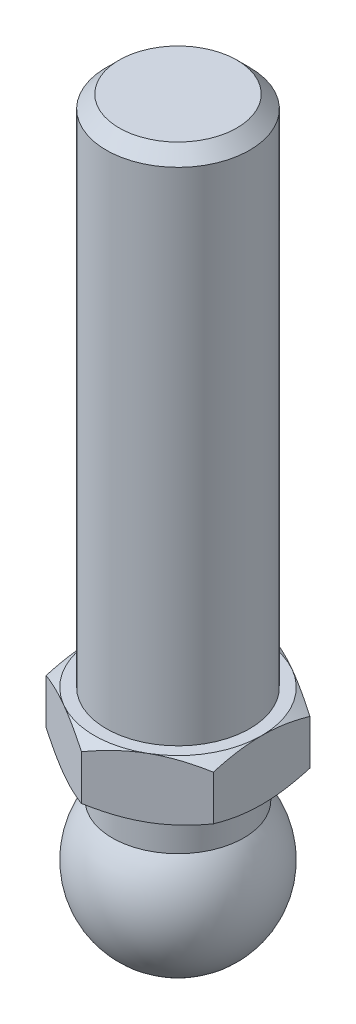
ISO-10303-21;
HEADER;
FILE_DESCRIPTION(('STEP AP214'),'2;1');
FILE_NAME('part.step','',(''),(''),'','','');
FILE_SCHEMA(('AUTOMOTIVE_DESIGN { 1 0 10303 214 1 1 1 1 }'));
ENDSEC;
DATA;
#1=APPLICATION_CONTEXT('core data for automotive mechanical design processes');
#2=APPLICATION_PROTOCOL_DEFINITION('international standard','automotive_design',2000,#1);
#3=PRODUCT_CONTEXT('',#1,'mechanical');
#4=PRODUCT('Part','Part','',(#3));
#5=PRODUCT_RELATED_PRODUCT_CATEGORY('part','',(#4));
#6=PRODUCT_DEFINITION_FORMATION('','',#4);
#7=PRODUCT_DEFINITION_CONTEXT('part definition',#1,'design');
#8=PRODUCT_DEFINITION('design','',#6,#7);
#9=PRODUCT_DEFINITION_SHAPE('','',#8);
#10=(LENGTH_UNIT() NAMED_UNIT(*) SI_UNIT(.MILLI.,.METRE.));
#11=(NAMED_UNIT(*) PLANE_ANGLE_UNIT() SI_UNIT($,.RADIAN.));
#12=(NAMED_UNIT(*) SI_UNIT($,.STERADIAN.) SOLID_ANGLE_UNIT());
#13=UNCERTAINTY_MEASURE_WITH_UNIT(LENGTH_MEASURE(1.E-05),#10,'distance_accuracy_value','');
#14=(GEOMETRIC_REPRESENTATION_CONTEXT(3) GLOBAL_UNCERTAINTY_ASSIGNED_CONTEXT((#13)) GLOBAL_UNIT_ASSIGNED_CONTEXT((#10,
#11,#12)) REPRESENTATION_CONTEXT('',''));
#15=CARTESIAN_POINT('',(0.,0.,0.));
#16=DIRECTION('',(0.,0.,1.));
#17=DIRECTION('',(1.,0.,0.));
#18=AXIS2_PLACEMENT_3D('',#15,#16,#17);
#19=CARTESIAN_POINT('',(0.,19.5,0.));
#20=DIRECTION('',(0.,-1.,0.));
#21=DIRECTION('',(0.,0.,-1.));
#22=AXIS2_PLACEMENT_3D('',#19,#20,#21);
#23=CONICAL_SURFACE('',#22,7.,1.0471975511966);
#24=CARTESIAN_POINT('',(-7.,15.2688336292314,12.5023453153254));
#25=CARTESIAN_POINT('',(-7.,15.4184696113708,12.2052647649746));
#26=CARTESIAN_POINT('',(-7.,15.5671267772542,11.9076861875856));
#27=CARTESIAN_POINT('',(-7.,15.8620076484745,11.3113035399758));
#28=CARTESIAN_POINT('',(-7.,16.0082312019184,11.0124993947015));
#29=CARTESIAN_POINT('',(-7.,16.2980281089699,10.4128982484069));
#30=CARTESIAN_POINT('',(-7.,16.441595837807,10.1120985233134));
#31=CARTESIAN_POINT('',(-7.,16.7251296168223,9.50881013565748));
#32=CARTESIAN_POINT('',(-7.,16.8650957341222,9.20632150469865));
#33=CARTESIAN_POINT('',(-7.,17.1470427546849,8.58510325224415));
#34=CARTESIAN_POINT('',(-7.,17.2888108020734,8.26627671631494));
#35=CARTESIAN_POINT('',(-7.,17.5662200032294,7.62594250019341));
#36=CARTESIAN_POINT('',(-7.,17.7018608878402,7.30443470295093));
#37=CARTESIAN_POINT('',(-7.,17.9652496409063,6.65840905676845));
#38=CARTESIAN_POINT('',(-7.,18.0930022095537,6.33389313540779));
#39=CARTESIAN_POINT('',(-7.,18.3384540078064,5.68109770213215));
#40=CARTESIAN_POINT('',(-7.,18.4561543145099,5.35281859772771));
#41=CARTESIAN_POINT('',(-7.,18.7028165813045,4.61998548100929));
#42=CARTESIAN_POINT('',(-7.,18.8286623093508,4.21436746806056));
#43=CARTESIAN_POINT('',(-7.,19.0543524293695,3.39574912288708));
#44=CARTESIAN_POINT('',(-7.,19.1541980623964,2.98274914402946));
#45=CARTESIAN_POINT('',(-7.,19.2776062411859,2.36178861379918));
#46=CARTESIAN_POINT('',(-7.,19.3141378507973,2.15638627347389));
#47=CARTESIAN_POINT('',(-7.,19.3780104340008,1.74416917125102));
#48=CARTESIAN_POINT('',(-7.,19.4053527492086,1.53735462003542));
#49=CARTESIAN_POINT('',(-7.,19.4500375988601,1.1227076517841));
#50=CARTESIAN_POINT('',(-7.,19.467383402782,0.914875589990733));
#51=CARTESIAN_POINT('',(-7.,19.4915250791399,0.498594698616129));
#52=CARTESIAN_POINT('',(-7.,19.4983210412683,0.290145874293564));
#53=CARTESIAN_POINT('',(-7.,19.5011397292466,-0.128421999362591));
#54=CARTESIAN_POINT('',(-7.,19.4970795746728,-0.338541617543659));
#55=CARTESIAN_POINT('',(-7.,19.4781521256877,-0.758289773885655));
#56=CARTESIAN_POINT('',(-7.,19.463284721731,-0.967918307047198));
#57=CARTESIAN_POINT('',(-7.,19.4232345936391,-1.38625975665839));
#58=CARTESIAN_POINT('',(-7.,19.3980479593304,-1.59497229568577));
#59=CARTESIAN_POINT('',(-7.,19.3381380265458,-2.01100790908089));
#60=CARTESIAN_POINT('',(-7.,19.3034145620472,-2.21833095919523));
#61=CARTESIAN_POINT('',(-7.,19.1849408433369,-2.84522045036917));
#62=CARTESIAN_POINT('',(-7.,19.0876569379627,-3.26225118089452));
#63=CARTESIAN_POINT('',(-7.,18.8658468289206,-4.08879182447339));
#64=CARTESIAN_POINT('',(-7.,18.7413180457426,-4.4983010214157));
#65=CARTESIAN_POINT('',(-7.,18.4953846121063,-5.2406101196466));
#66=CARTESIAN_POINT('',(-7.,18.3771372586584,-5.5744719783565));
#67=CARTESIAN_POINT('',(-7.,18.1300009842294,-6.23825206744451));
#68=CARTESIAN_POINT('',(-7.,18.0011107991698,-6.56816982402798));
#69=CARTESIAN_POINT('',(-7.,17.7350197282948,-7.22486424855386));
#70=CARTESIAN_POINT('',(-7.,17.5978135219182,-7.55163874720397));
#71=CARTESIAN_POINT('',(-7.,17.3169731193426,-8.20238370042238));
#72=CARTESIAN_POINT('',(-7.,17.1733392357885,-8.5263542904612));
#73=CARTESIAN_POINT('',(-7.,16.8876445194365,-9.15729037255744));
#74=CARTESIAN_POINT('',(-7.,16.7458097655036,-9.46435857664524));
#75=CARTESIAN_POINT('',(-7.,16.4583976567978,-10.0767426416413));
#76=CARTESIAN_POINT('',(-7.,16.3128202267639,-10.3820584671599));
#77=CARTESIAN_POINT('',(-7.,16.018926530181,-10.990585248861));
#78=CARTESIAN_POINT('',(-7.,15.8706165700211,-11.2937992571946));
#79=CARTESIAN_POINT('',(-7.,15.5714843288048,-11.8989613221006));
#80=CARTESIAN_POINT('',(-7.,15.4206622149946,-12.2009094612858));
#81=CARTESIAN_POINT('',(-7.,15.2688336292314,-12.5023453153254));
#82=B_SPLINE_CURVE_WITH_KNOTS('',3,(#24,#25,#26,#27,#28,#29,#30,#31,#32,#33,#34,#35,#36,#37,#38,
#39,#40,#41,#42,#43,#44,#45,#46,#47,#48,#49,#50,#51,#52,#53,#54,#55,#56,#57,#58,#59,#60,#61,#62,
#63,#64,#65,#66,#67,#68,#69,#70,#71,#72,#73,#74,#75,#76,#77,#78,#79,#80,#81),.UNSPECIFIED.,.F.,
.F.,(4,2,2,2,2,2,2,2,2,2,2,2,2,2,2,2,2,2,2,2,2,2,2,2,2,2,2,2,4),(0.,0.997917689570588,
1.99589743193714,2.99579247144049,3.99566886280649,5.04239250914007,6.08916209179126,
7.13530182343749,8.18132932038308,9.45480706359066,10.7282240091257,11.3539282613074,
11.9795411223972,12.6049492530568,13.2303520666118,13.8605430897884,14.490740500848,
15.1211769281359,15.7516243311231,17.0349275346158,18.3183522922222,19.380686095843,
20.4431462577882,21.506293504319,22.5693890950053,23.5840866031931,24.5988045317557,
25.6114179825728,26.6239642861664),.UNSPECIFIED.);
#83=CARTESIAN_POINT('',(-7.,18.8747852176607,4.04145188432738));
#84=VERTEX_POINT('',#83);
#85=CARTESIAN_POINT('',(-7.,19.5,0.));
#86=VERTEX_POINT('',#85);
#87=EDGE_CURVE('E258',#84,#86,#82,.T.);
#88=ORIENTED_EDGE('',*,*,#87,.F.);
#89=CARTESIAN_POINT('',(0.0002,18.8747185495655,8.0830192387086));
#90=CARTESIAN_POINT('',(-0.153667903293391,18.9260001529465,7.99418356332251));
#91=CARTESIAN_POINT('',(-0.30810950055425,18.9749544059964,7.90501666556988));
#92=CARTESIAN_POINT('',(-0.618246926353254,19.0675672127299,7.72595873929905));
#93=CARTESIAN_POINT('',(-0.773943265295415,19.1112234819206,7.63606741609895));
#94=CARTESIAN_POINT('',(-1.24352516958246,19.2333884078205,7.36495417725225));
#95=CARTESIAN_POINT('',(-1.5592643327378,19.302874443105,7.18266208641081));
#96=CARTESIAN_POINT('',(-2.03176224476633,19.3843550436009,6.9098652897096));
#97=CARTESIAN_POINT('',(-2.18710922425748,19.4075665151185,6.82017566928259));
#98=CARTESIAN_POINT('',(-2.49850511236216,19.4464887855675,6.64039116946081));
#99=CARTESIAN_POINT('',(-2.65455395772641,19.4622002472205,6.55029632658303));
#100=CARTESIAN_POINT('',(-2.96692267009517,19.4857220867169,6.36995016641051));
#101=CARTESIAN_POINT('',(-3.12324202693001,19.4935414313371,6.27969914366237));
#102=CARTESIAN_POINT('',(-3.43601650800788,19.5011197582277,6.09911871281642));
#103=CARTESIAN_POINT('',(-3.59247162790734,19.500878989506,6.00878930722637));
#104=CARTESIAN_POINT('',(-4.02110687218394,19.4891402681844,5.76131663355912));
#105=CARTESIAN_POINT('',(-4.2931466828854,19.4694342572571,5.60425437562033));
#106=CARTESIAN_POINT('',(-4.83541944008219,19.4069465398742,5.29117305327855));
#107=CARTESIAN_POINT('',(-5.10565047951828,19.364143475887,5.13515508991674));
#108=CARTESIAN_POINT('',(-5.64901454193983,19.2571483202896,4.82144370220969));
#109=CARTESIAN_POINT('',(-5.92207900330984,19.1925029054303,4.66378986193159));
#110=CARTESIAN_POINT('',(-6.46413578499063,19.045783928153,4.35083323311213));
#111=CARTESIAN_POINT('',(-6.73313504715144,18.9637448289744,4.19552643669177));
#112=CARTESIAN_POINT('',(-7.0002,18.8747185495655,4.04133641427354));
#113=B_SPLINE_CURVE_WITH_KNOTS('',3,(#89,#90,#91,#92,#93,#94,#95,#96,#97,#98,#99,#100,#101,#102,
#103,#104,#105,#106,#107,#108,#109,#110,#111,#112),.UNSPECIFIED.,.F.,.F.,(4,2,2,2,2,2,2,2,2,2,2,
4),(0.,0.554727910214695,1.10969417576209,2.2219327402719,2.76443041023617,3.30688013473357,
3.8487128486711,4.39052882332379,5.33376515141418,6.27787517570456,7.2429241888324,
8.20607866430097),.UNSPECIFIED.);
#114=CARTESIAN_POINT('',(-3.5,19.5,6.06217782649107));
#115=VERTEX_POINT('',#114);
#116=EDGE_CURVE('E144',#115,#84,#113,.T.);
#117=ORIENTED_EDGE('',*,*,#116,.F.);
#118=CARTESIAN_POINT('',(0.,19.5,0.));
#119=DIRECTION('',(0.,-1.,0.));
#120=DIRECTION('',(0.,0.,-1.));
#121=AXIS2_PLACEMENT_3D('',#118,#119,#120);
#122=CIRCLE('',#121,7.);
#123=EDGE_CURVE('E226',#115,#86,#122,.T.);
#124=ORIENTED_EDGE('',*,*,#123,.T.);
#125=EDGE_LOOP('',(#88,#117,#124));
#126=FACE_BOUND('',#125,.T.);
#127=ADVANCED_FACE('F17',(#126),#23,.T.);
#128=CARTESIAN_POINT('',(-7.,18.8747852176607,-4.04145188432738));
#129=VERTEX_POINT('',#128);
#130=EDGE_CURVE('E260',#86,#129,#82,.T.);
#131=ORIENTED_EDGE('',*,*,#130,.F.);
#132=CARTESIAN_POINT('',(-3.5,19.5,-6.06217782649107));
#133=VERTEX_POINT('',#132);
#134=EDGE_CURVE('E243',#86,#133,#122,.T.);
#135=ORIENTED_EDGE('',*,*,#134,.T.);
#136=CARTESIAN_POINT('',(-7.0002,18.8747185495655,-4.04133641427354));
#137=CARTESIAN_POINT('',(-6.84633209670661,18.9260001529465,-4.13017208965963));
#138=CARTESIAN_POINT('',(-6.69189049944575,18.9749544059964,-4.21933898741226));
#139=CARTESIAN_POINT('',(-6.38175307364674,19.0675672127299,-4.39839691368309));
#140=CARTESIAN_POINT('',(-6.22605673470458,19.1112234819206,-4.48828823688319));
#141=CARTESIAN_POINT('',(-5.75647483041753,19.2333884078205,-4.75940147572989));
#142=CARTESIAN_POINT('',(-5.4407356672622,19.302874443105,-4.94169356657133));
#143=CARTESIAN_POINT('',(-4.96823775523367,19.3843550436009,-5.21449036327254));
#144=CARTESIAN_POINT('',(-4.81289077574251,19.4075665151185,-5.30417998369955));
#145=CARTESIAN_POINT('',(-4.50149488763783,19.4464887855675,-5.48396448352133));
#146=CARTESIAN_POINT('',(-4.34544604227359,19.4622002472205,-5.57405932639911));
#147=CARTESIAN_POINT('',(-4.03307732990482,19.4857220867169,-5.75440548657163));
#148=CARTESIAN_POINT('',(-3.87675797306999,19.4935414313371,-5.84465650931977));
#149=CARTESIAN_POINT('',(-3.56398349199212,19.5011197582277,-6.02523694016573));
#150=CARTESIAN_POINT('',(-3.40752837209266,19.500878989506,-6.11556634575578));
#151=CARTESIAN_POINT('',(-2.97889312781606,19.4891402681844,-6.36303901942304));
#152=CARTESIAN_POINT('',(-2.7068533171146,19.4694342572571,-6.52010127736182));
#153=CARTESIAN_POINT('',(-2.1645805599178,19.4069465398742,-6.83318259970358));
#154=CARTESIAN_POINT('',(-1.89434952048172,19.364143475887,-6.9892005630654));
#155=CARTESIAN_POINT('',(-1.35098545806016,19.2571483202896,-7.30291195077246));
#156=CARTESIAN_POINT('',(-1.07792099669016,19.1925029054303,-7.46056579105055));
#157=CARTESIAN_POINT('',(-0.53586421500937,19.045783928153,-7.77352241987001));
#158=CARTESIAN_POINT('',(-0.26686495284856,18.9637448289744,-7.92882921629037));
#159=CARTESIAN_POINT('',(0.000200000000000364,18.8747185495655,-8.0830192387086));
#160=B_SPLINE_CURVE_WITH_KNOTS('',3,(#136,#137,#138,#139,#140,#141,#142,#143,#144,#145,#146,
#147,#148,#149,#150,#151,#152,#153,#154,#155,#156,#157,#158,#159),.UNSPECIFIED.,.F.,.F.,(4,2,2,
2,2,2,2,2,2,2,2,4),(0.,0.554727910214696,1.10969417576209,2.2219327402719,2.76443041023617,
3.30688013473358,3.8487128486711,4.39052882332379,5.33376515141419,6.27787517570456,
7.2429241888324,8.20607866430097),.UNSPECIFIED.);
#161=EDGE_CURVE('E301',#129,#133,#160,.T.);
#162=ORIENTED_EDGE('',*,*,#161,.F.);
#163=EDGE_LOOP('',(#131,#135,#162));
#164=FACE_BOUND('',#163,.T.);
#165=ADVANCED_FACE('F182',(#164),#23,.T.);
#166=CARTESIAN_POINT('',(0.,18.8747852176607,-8.08290376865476));
#167=VERTEX_POINT('',#166);
#168=EDGE_CURVE('E296',#133,#167,#160,.T.);
#169=ORIENTED_EDGE('',*,*,#168,.F.);
#170=CARTESIAN_POINT('',(3.5,19.5,-6.06217782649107));
#171=VERTEX_POINT('',#170);
#172=EDGE_CURVE('E237',#133,#171,#122,.T.);
#173=ORIENTED_EDGE('',*,*,#172,.T.);
#174=CARTESIAN_POINT('',(-0.0002,18.8747185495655,-8.0830192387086));
#175=CARTESIAN_POINT('',(0.153667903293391,18.9260001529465,-7.99418356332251));
#176=CARTESIAN_POINT('',(0.30810950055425,18.9749544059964,-7.90501666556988));
#177=CARTESIAN_POINT('',(0.618246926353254,19.0675672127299,-7.72595873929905));
#178=CARTESIAN_POINT('',(0.773943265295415,19.1112234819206,-7.63606741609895));
#179=CARTESIAN_POINT('',(1.24352516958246,19.2333884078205,-7.36495417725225));
#180=CARTESIAN_POINT('',(1.5592643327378,19.302874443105,-7.18266208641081));
#181=CARTESIAN_POINT('',(2.03176224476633,19.3843550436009,-6.9098652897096));
#182=CARTESIAN_POINT('',(2.18710922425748,19.4075665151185,-6.82017566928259));
#183=CARTESIAN_POINT('',(2.49850511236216,19.4464887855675,-6.64039116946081));
#184=CARTESIAN_POINT('',(2.65455395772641,19.4622002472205,-6.55029632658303));
#185=CARTESIAN_POINT('',(2.96692267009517,19.4857220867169,-6.36995016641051));
#186=CARTESIAN_POINT('',(3.12324202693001,19.4935414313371,-6.27969914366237));
#187=CARTESIAN_POINT('',(3.43601650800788,19.5011197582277,-6.09911871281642));
#188=CARTESIAN_POINT('',(3.59247162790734,19.500878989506,-6.00878930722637));
#189=CARTESIAN_POINT('',(4.02110687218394,19.4891402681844,-5.76131663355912));
#190=CARTESIAN_POINT('',(4.2931466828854,19.4694342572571,-5.60425437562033));
#191=CARTESIAN_POINT('',(4.83541944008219,19.4069465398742,-5.29117305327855));
#192=CARTESIAN_POINT('',(5.10565047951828,19.364143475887,-5.13515508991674));
#193=CARTESIAN_POINT('',(5.64901454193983,19.2571483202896,-4.82144370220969));
#194=CARTESIAN_POINT('',(5.92207900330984,19.1925029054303,-4.66378986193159));
#195=CARTESIAN_POINT('',(6.46413578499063,19.045783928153,-4.35083323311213));
#196=CARTESIAN_POINT('',(6.73313504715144,18.9637448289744,-4.19552643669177));
#197=CARTESIAN_POINT('',(7.0002,18.8747185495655,-4.04133641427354));
#198=B_SPLINE_CURVE_WITH_KNOTS('',3,(#174,#175,#176,#177,#178,#179,#180,#181,#182,#183,#184,
#185,#186,#187,#188,#189,#190,#191,#192,#193,#194,#195,#196,#197),.UNSPECIFIED.,.F.,.F.,(4,2,2,
2,2,2,2,2,2,2,2,4),(0.,0.554727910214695,1.10969417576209,2.2219327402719,2.76443041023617,
3.30688013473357,3.8487128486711,4.39052882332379,5.33376515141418,6.27787517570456,
7.2429241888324,8.20607866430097),.UNSPECIFIED.);
#199=EDGE_CURVE('E307',#167,#171,#198,.T.);
#200=ORIENTED_EDGE('',*,*,#199,.F.);
#201=EDGE_LOOP('',(#169,#173,#200));
#202=FACE_BOUND('',#201,.T.);
#203=ADVANCED_FACE('F189',(#202),#23,.T.);
#204=CARTESIAN_POINT('',(7.,18.8747852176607,-4.04145188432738));
#205=VERTEX_POINT('',#204);
#206=EDGE_CURVE('E309',#171,#205,#198,.T.);
#207=ORIENTED_EDGE('',*,*,#206,.F.);
#208=CARTESIAN_POINT('',(7.,19.5,0.));
#209=VERTEX_POINT('',#208);
#210=EDGE_CURVE('E233',#171,#209,#122,.T.);
#211=ORIENTED_EDGE('',*,*,#210,.T.);
#212=CARTESIAN_POINT('',(7.,15.2688336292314,-12.5023453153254));
#213=CARTESIAN_POINT('',(7.,15.4184696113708,-12.2052647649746));
#214=CARTESIAN_POINT('',(7.,15.5671267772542,-11.9076861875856));
#215=CARTESIAN_POINT('',(7.,15.8620076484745,-11.3113035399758));
#216=CARTESIAN_POINT('',(7.,16.0082312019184,-11.0124993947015));
#217=CARTESIAN_POINT('',(7.,16.2980281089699,-10.4128982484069));
#218=CARTESIAN_POINT('',(7.,16.441595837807,-10.1120985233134));
#219=CARTESIAN_POINT('',(7.,16.7251296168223,-9.50881013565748));
#220=CARTESIAN_POINT('',(7.,16.8650957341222,-9.20632150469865));
#221=CARTESIAN_POINT('',(7.,17.1470427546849,-8.58510325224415));
#222=CARTESIAN_POINT('',(7.,17.2888108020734,-8.26627671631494));
#223=CARTESIAN_POINT('',(7.,17.5662200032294,-7.62594250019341));
#224=CARTESIAN_POINT('',(7.,17.7018608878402,-7.30443470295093));
#225=CARTESIAN_POINT('',(7.,17.9652496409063,-6.65840905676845));
#226=CARTESIAN_POINT('',(7.,18.0930022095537,-6.33389313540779));
#227=CARTESIAN_POINT('',(7.,18.3384540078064,-5.68109770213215));
#228=CARTESIAN_POINT('',(7.,18.4561543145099,-5.35281859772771));
#229=CARTESIAN_POINT('',(7.,18.7028165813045,-4.61998548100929));
#230=CARTESIAN_POINT('',(7.,18.8286623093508,-4.21436746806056));
#231=CARTESIAN_POINT('',(7.,19.0543524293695,-3.39574912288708));
#232=CARTESIAN_POINT('',(7.,19.1541980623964,-2.98274914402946));
#233=CARTESIAN_POINT('',(7.,19.2776062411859,-2.36178861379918));
#234=CARTESIAN_POINT('',(7.,19.3141378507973,-2.15638627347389));
#235=CARTESIAN_POINT('',(7.,19.3780104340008,-1.74416917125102));
#236=CARTESIAN_POINT('',(7.,19.4053527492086,-1.53735462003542));
#237=CARTESIAN_POINT('',(7.,19.4500375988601,-1.1227076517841));
#238=CARTESIAN_POINT('',(7.,19.467383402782,-0.914875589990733));
#239=CARTESIAN_POINT('',(7.,19.4915250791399,-0.498594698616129));
#240=CARTESIAN_POINT('',(7.,19.4983210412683,-0.290145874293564));
#241=CARTESIAN_POINT('',(7.,19.5011397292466,0.128421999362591));
#242=CARTESIAN_POINT('',(7.,19.4970795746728,0.338541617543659));
#243=CARTESIAN_POINT('',(7.,19.4781521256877,0.758289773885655));
#244=CARTESIAN_POINT('',(7.,19.463284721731,0.967918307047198));
#245=CARTESIAN_POINT('',(7.,19.4232345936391,1.38625975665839));
#246=CARTESIAN_POINT('',(7.,19.3980479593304,1.59497229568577));
#247=CARTESIAN_POINT('',(7.,19.3381380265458,2.01100790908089));
#248=CARTESIAN_POINT('',(7.,19.3034145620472,2.21833095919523));
#249=CARTESIAN_POINT('',(7.,19.1849408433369,2.84522045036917));
#250=CARTESIAN_POINT('',(7.,19.0876569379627,3.26225118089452));
#251=CARTESIAN_POINT('',(7.,18.8658468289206,4.08879182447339));
#252=CARTESIAN_POINT('',(7.,18.7413180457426,4.4983010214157));
#253=CARTESIAN_POINT('',(7.,18.4953846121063,5.2406101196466));
#254=CARTESIAN_POINT('',(7.,18.3771372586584,5.5744719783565));
#255=CARTESIAN_POINT('',(7.,18.1300009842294,6.23825206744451));
#256=CARTESIAN_POINT('',(7.,18.0011107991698,6.56816982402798));
#257=CARTESIAN_POINT('',(7.,17.7350197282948,7.22486424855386));
#258=CARTESIAN_POINT('',(7.,17.5978135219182,7.55163874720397));
#259=CARTESIAN_POINT('',(7.,17.3169731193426,8.20238370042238));
#260=CARTESIAN_POINT('',(7.,17.1733392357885,8.5263542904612));
#261=CARTESIAN_POINT('',(7.,16.8876445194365,9.15729037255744));
#262=CARTESIAN_POINT('',(7.,16.7458097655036,9.46435857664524));
#263=CARTESIAN_POINT('',(7.,16.4583976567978,10.0767426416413));
#264=CARTESIAN_POINT('',(7.,16.3128202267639,10.3820584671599));
#265=CARTESIAN_POINT('',(7.,16.018926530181,10.990585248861));
#266=CARTESIAN_POINT('',(7.,15.8706165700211,11.2937992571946));
#267=CARTESIAN_POINT('',(7.,15.5714843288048,11.8989613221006));
#268=CARTESIAN_POINT('',(7.,15.4206622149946,12.2009094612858));
#269=CARTESIAN_POINT('',(7.,15.2688336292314,12.5023453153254));
#270=B_SPLINE_CURVE_WITH_KNOTS('',3,(#212,#213,#214,#215,#216,#217,#218,#219,#220,#221,#222,
#223,#224,#225,#226,#227,#228,#229,#230,#231,#232,#233,#234,#235,#236,#237,#238,#239,#240,#241,
#242,#243,#244,#245,#246,#247,#248,#249,#250,#251,#252,#253,#254,#255,#256,#257,#258,#259,#260,
#261,#262,#263,#264,#265,#266,#267,#268,#269),.UNSPECIFIED.,.F.,.F.,(4,2,2,2,2,2,2,2,2,2,2,2,2,
2,2,2,2,2,2,2,2,2,2,2,2,2,2,2,4),(0.,0.997917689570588,1.99589743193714,2.99579247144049,
3.99566886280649,5.04239250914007,6.08916209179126,7.13530182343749,8.18132932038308,
9.45480706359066,10.7282240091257,11.3539282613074,11.9795411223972,12.6049492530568,
13.2303520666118,13.8605430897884,14.490740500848,15.1211769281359,15.7516243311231,
17.0349275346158,18.3183522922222,19.380686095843,20.4431462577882,21.506293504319,
22.5693890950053,23.5840866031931,24.5988045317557,25.6114179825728,26.6239642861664),.UNSPECIFIED.);
#271=EDGE_CURVE('E324',#205,#209,#270,.T.);
#272=ORIENTED_EDGE('',*,*,#271,.F.);
#273=EDGE_LOOP('',(#207,#211,#272));
#274=FACE_BOUND('',#273,.T.);
#275=ADVANCED_FACE('F204',(#274),#23,.T.);
#276=CARTESIAN_POINT('',(7.,18.8747852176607,4.04145188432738));
#277=VERTEX_POINT('',#276);
#278=EDGE_CURVE('E230',#209,#277,#270,.T.);
#279=ORIENTED_EDGE('',*,*,#278,.F.);
#280=CARTESIAN_POINT('',(3.5,19.5,6.06217782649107));
#281=VERTEX_POINT('',#280);
#282=EDGE_CURVE('E223',#209,#281,#122,.T.);
#283=ORIENTED_EDGE('',*,*,#282,.T.);
#284=CARTESIAN_POINT('',(7.0002,18.8747185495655,4.04133641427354));
#285=CARTESIAN_POINT('',(6.84633209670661,18.9260001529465,4.13017208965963));
#286=CARTESIAN_POINT('',(6.69189049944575,18.9749544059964,4.21933898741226));
#287=CARTESIAN_POINT('',(6.38175307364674,19.0675672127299,4.39839691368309));
#288=CARTESIAN_POINT('',(6.22605673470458,19.1112234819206,4.48828823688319));
#289=CARTESIAN_POINT('',(5.75647483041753,19.2333884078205,4.75940147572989));
#290=CARTESIAN_POINT('',(5.4407356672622,19.302874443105,4.94169356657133));
#291=CARTESIAN_POINT('',(4.96823775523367,19.3843550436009,5.21449036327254));
#292=CARTESIAN_POINT('',(4.81289077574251,19.4075665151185,5.30417998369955));
#293=CARTESIAN_POINT('',(4.50149488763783,19.4464887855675,5.48396448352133));
#294=CARTESIAN_POINT('',(4.34544604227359,19.4622002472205,5.57405932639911));
#295=CARTESIAN_POINT('',(4.03307732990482,19.4857220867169,5.75440548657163));
#296=CARTESIAN_POINT('',(3.87675797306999,19.4935414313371,5.84465650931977));
#297=CARTESIAN_POINT('',(3.56398349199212,19.5011197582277,6.02523694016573));
#298=CARTESIAN_POINT('',(3.40752837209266,19.500878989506,6.11556634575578));
#299=CARTESIAN_POINT('',(2.97889312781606,19.4891402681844,6.36303901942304));
#300=CARTESIAN_POINT('',(2.7068533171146,19.4694342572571,6.52010127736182));
#301=CARTESIAN_POINT('',(2.1645805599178,19.4069465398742,6.83318259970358));
#302=CARTESIAN_POINT('',(1.89434952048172,19.364143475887,6.9892005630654));
#303=CARTESIAN_POINT('',(1.35098545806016,19.2571483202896,7.30291195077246));
#304=CARTESIAN_POINT('',(1.07792099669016,19.1925029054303,7.46056579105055));
#305=CARTESIAN_POINT('',(0.53586421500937,19.045783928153,7.77352241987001));
#306=CARTESIAN_POINT('',(0.26686495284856,18.9637448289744,7.92882921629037));
#307=CARTESIAN_POINT('',(-0.000200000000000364,18.8747185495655,8.0830192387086));
#308=B_SPLINE_CURVE_WITH_KNOTS('',3,(#284,#285,#286,#287,#288,#289,#290,#291,#292,#293,#294,
#295,#296,#297,#298,#299,#300,#301,#302,#303,#304,#305,#306,#307),.UNSPECIFIED.,.F.,.F.,(4,2,2,
2,2,2,2,2,2,2,2,4),(0.,0.554727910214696,1.10969417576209,2.2219327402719,2.76443041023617,
3.30688013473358,3.8487128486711,4.39052882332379,5.33376515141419,6.27787517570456,
7.2429241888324,8.20607866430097),.UNSPECIFIED.);
#309=EDGE_CURVE('E213',#277,#281,#308,.T.);
#310=ORIENTED_EDGE('',*,*,#309,.F.);
#311=EDGE_LOOP('',(#279,#283,#310));
#312=FACE_BOUND('',#311,.T.);
#313=ADVANCED_FACE('F195',(#312),#23,.T.);
#314=CARTESIAN_POINT('',(0.,18.8747852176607,8.08290376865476));
#315=VERTEX_POINT('',#314);
#316=EDGE_CURVE('E208',#281,#315,#308,.T.);
#317=ORIENTED_EDGE('',*,*,#316,.F.);
#318=EDGE_CURVE('E210',#281,#115,#122,.T.);
#319=ORIENTED_EDGE('',*,*,#318,.T.);
#320=EDGE_CURVE('E32',#315,#115,#113,.T.);
#321=ORIENTED_EDGE('',*,*,#320,.F.);
#322=EDGE_LOOP('',(#317,#319,#321));
#323=FACE_BOUND('',#322,.T.);
#324=ADVANCED_FACE('F184',(#323),#23,.T.);
#325=CARTESIAN_POINT('',(0.,62.5,0.));
#326=DIRECTION('',(0.,-1.,0.));
#327=DIRECTION('',(0.,0.,-1.));
#328=AXIS2_PLACEMENT_3D('',#325,#326,#327);
#329=PLANE('',#328);
#330=CARTESIAN_POINT('',(0.,62.5,0.));
#331=DIRECTION('',(0.,-1.,0.));
#332=DIRECTION('',(0.,0.,-1.));
#333=AXIS2_PLACEMENT_3D('',#330,#331,#332);
#334=CIRCLE('',#333,4.9265);
#335=CARTESIAN_POINT('',(0.,62.5,-4.9265));
#336=VERTEX_POINT('',#335);
#337=EDGE_CURVE('E11',#336,#336,#334,.T.);
#338=ORIENTED_EDGE('',*,*,#337,.F.);
#339=EDGE_LOOP('',(#338));
#340=FACE_BOUND('',#339,.T.);
#341=ADVANCED_FACE('F19',(#340),#329,.F.);
#342=CARTESIAN_POINT('',(0.,62.5,0.));
#343=DIRECTION('',(0.,-1.,0.));
#344=DIRECTION('',(0.,0.,-1.));
#345=AXIS2_PLACEMENT_3D('',#342,#343,#344);
#346=CONICAL_SURFACE('',#345,4.9265,0.785398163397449);
#347=CARTESIAN_POINT('',(0.,61.4265,0.));
#348=DIRECTION('',(0.,-1.,0.));
#349=DIRECTION('',(0.,0.,-1.));
#350=AXIS2_PLACEMENT_3D('',#347,#348,#349);
#351=CIRCLE('',#350,6.);
#352=CARTESIAN_POINT('',(0.,61.4265,-6.));
#353=VERTEX_POINT('',#352);
#354=EDGE_CURVE('E25',#353,#353,#351,.T.);
#355=ORIENTED_EDGE('',*,*,#354,.F.);
#356=EDGE_LOOP('',(#355));
#357=FACE_BOUND('',#356,.T.);
#358=ORIENTED_EDGE('',*,*,#337,.T.);
#359=EDGE_LOOP('',(#358));
#360=FACE_BOUND('',#359,.T.);
#361=ADVANCED_FACE('F202',(#357,#360),#346,.T.);
#362=CARTESIAN_POINT('',(0.,0.,0.));
#363=DIRECTION('',(0.,-1.,0.));
#364=DIRECTION('',(0.,0.,-1.));
#365=AXIS2_PLACEMENT_3D('',#362,#363,#364);
#366=CYLINDRICAL_SURFACE('',#365,6.);
#367=CARTESIAN_POINT('',(0.,19.5,0.));
#368=DIRECTION('',(0.,-1.,0.));
#369=DIRECTION('',(0.,0.,-1.));
#370=AXIS2_PLACEMENT_3D('',#367,#368,#369);
#371=CIRCLE('',#370,6.);
#372=CARTESIAN_POINT('',(0.,19.5,-6.));
#373=VERTEX_POINT('',#372);
#374=EDGE_CURVE('E232',#373,#373,#371,.T.);
#375=ORIENTED_EDGE('',*,*,#374,.F.);
#376=EDGE_LOOP('',(#375));
#377=FACE_BOUND('',#376,.T.);
#378=ORIENTED_EDGE('',*,*,#354,.T.);
#379=EDGE_LOOP('',(#378));
#380=FACE_BOUND('',#379,.T.);
#381=ADVANCED_FACE('F486',(#377,#380),#366,.T.);
#382=CARTESIAN_POINT('',(6.,19.5,0.));
#383=DIRECTION('',(0.,-1.,0.));
#384=DIRECTION('',(0.,0.,-1.));
#385=AXIS2_PLACEMENT_3D('',#382,#383,#384);
#386=PLANE('',#385);
#387=ORIENTED_EDGE('',*,*,#282,.F.);
#388=ORIENTED_EDGE('',*,*,#210,.F.);
#389=ORIENTED_EDGE('',*,*,#172,.F.);
#390=ORIENTED_EDGE('',*,*,#134,.F.);
#391=ORIENTED_EDGE('',*,*,#123,.F.);
#392=ORIENTED_EDGE('',*,*,#318,.F.);
#393=EDGE_LOOP('',(#387,#388,#389,#390,#391,#392));
#394=FACE_BOUND('',#393,.T.);
#395=ORIENTED_EDGE('',*,*,#374,.T.);
#396=EDGE_LOOP('',(#395));
#397=FACE_BOUND('',#396,.T.);
#398=ADVANCED_FACE('F220',(#394,#397),#386,.F.);
#399=CARTESIAN_POINT('',(-7.,14.3,-4.04145188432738));
#400=DIRECTION('',(-1.,0.,0.));
#401=DIRECTION('',(0.,0.,1.));
#402=AXIS2_PLACEMENT_3D('',#399,#400,#401);
#403=PLANE('',#402);
#404=ORIENTED_EDGE('',*,*,#87,.T.);
#405=ORIENTED_EDGE('',*,*,#130,.T.);
#406=DIRECTION('',(0.,1.,0.));
#407=VECTOR('',#406,1.);
#408=CARTESIAN_POINT('',(-7.,14.3,-4.04145188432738));
#409=LINE('',#408,#407);
#410=CARTESIAN_POINT('',(-7.,15.1252147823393,-4.04145188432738));
#411=VERTEX_POINT('',#410);
#412=EDGE_CURVE('E123',#411,#129,#409,.T.);
#413=ORIENTED_EDGE('',*,*,#412,.F.);
#414=CARTESIAN_POINT('',(-7.,18.7311663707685,-12.5023453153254));
#415=CARTESIAN_POINT('',(-7.,18.5815303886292,-12.2052647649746));
#416=CARTESIAN_POINT('',(-7.,18.4328732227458,-11.9076861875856));
#417=CARTESIAN_POINT('',(-7.,18.1379923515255,-11.3113035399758));
#418=CARTESIAN_POINT('',(-7.,17.9917687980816,-11.0124993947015));
#419=CARTESIAN_POINT('',(-7.,17.7019718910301,-10.4128982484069));
#420=CARTESIAN_POINT('',(-7.,17.558404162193,-10.1120985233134));
#421=CARTESIAN_POINT('',(-7.,17.2748703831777,-9.50881013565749));
#422=CARTESIAN_POINT('',(-7.,17.1349042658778,-9.20632150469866));
#423=CARTESIAN_POINT('',(-7.,16.8529572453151,-8.58510325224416));
#424=CARTESIAN_POINT('',(-7.,16.7111891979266,-8.26627671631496));
#425=CARTESIAN_POINT('',(-7.,16.4337799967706,-7.62594250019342));
#426=CARTESIAN_POINT('',(-7.,16.2981391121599,-7.30443470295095));
#427=CARTESIAN_POINT('',(-7.,16.0347503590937,-6.65840905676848));
#428=CARTESIAN_POINT('',(-7.,15.9069977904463,-6.33389313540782));
#429=CARTESIAN_POINT('',(-7.,15.6615459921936,-5.68109770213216));
#430=CARTESIAN_POINT('',(-7.,15.5438456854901,-5.35281859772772));
#431=CARTESIAN_POINT('',(-7.,15.2971834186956,-4.6199854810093));
#432=CARTESIAN_POINT('',(-7.,15.1713376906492,-4.21436746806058));
#433=CARTESIAN_POINT('',(-7.,14.9456475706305,-3.39574912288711));
#434=CARTESIAN_POINT('',(-7.,14.8458019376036,-2.98274914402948));
#435=CARTESIAN_POINT('',(-7.,14.7223937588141,-2.3617886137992));
#436=CARTESIAN_POINT('',(-7.,14.6858621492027,-2.1563862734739));
#437=CARTESIAN_POINT('',(-7.,14.6219895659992,-1.74416917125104));
#438=CARTESIAN_POINT('',(-7.,14.5946472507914,-1.53735462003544));
#439=CARTESIAN_POINT('',(-7.,14.5499624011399,-1.12270765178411));
#440=CARTESIAN_POINT('',(-7.,14.532616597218,-0.914875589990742));
#441=CARTESIAN_POINT('',(-7.,14.5084749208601,-0.498594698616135));
#442=CARTESIAN_POINT('',(-7.,14.5016789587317,-0.290145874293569));
#443=CARTESIAN_POINT('',(-7.,14.4988602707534,0.128421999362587));
#444=CARTESIAN_POINT('',(-7.,14.5029204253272,0.338541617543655));
#445=CARTESIAN_POINT('',(-7.,14.5218478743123,0.758289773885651));
#446=CARTESIAN_POINT('',(-7.,14.5367152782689,0.967918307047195));
#447=CARTESIAN_POINT('',(-7.,14.5767654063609,1.38625975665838));
#448=CARTESIAN_POINT('',(-7.,14.6019520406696,1.59497229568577));
#449=CARTESIAN_POINT('',(-7.,14.6618619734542,2.01100790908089));
#450=CARTESIAN_POINT('',(-7.,14.6965854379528,2.21833095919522));
#451=CARTESIAN_POINT('',(-7.,14.8150591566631,2.84522045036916));
#452=CARTESIAN_POINT('',(-7.,14.9123430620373,3.26225118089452));
#453=CARTESIAN_POINT('',(-7.,15.1341531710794,4.08879182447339));
#454=CARTESIAN_POINT('',(-7.,15.2586819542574,4.4983010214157));
#455=CARTESIAN_POINT('',(-7.,15.5046153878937,5.2406101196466));
#456=CARTESIAN_POINT('',(-7.,15.6228627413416,5.5744719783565));
#457=CARTESIAN_POINT('',(-7.,15.8699990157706,6.23825206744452));
#458=CARTESIAN_POINT('',(-7.,15.9988892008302,6.56816982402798));
#459=CARTESIAN_POINT('',(-7.,16.2649802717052,7.22486424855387));
#460=CARTESIAN_POINT('',(-7.,16.4021864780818,7.55163874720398));
#461=CARTESIAN_POINT('',(-7.,16.6830268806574,8.20238370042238));
#462=CARTESIAN_POINT('',(-7.,16.8266607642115,8.5263542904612));
#463=CARTESIAN_POINT('',(-7.,17.1123554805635,9.15729037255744));
#464=CARTESIAN_POINT('',(-7.,17.2541902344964,9.46435857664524));
#465=CARTESIAN_POINT('',(-7.,17.5416023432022,10.0767426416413));
#466=CARTESIAN_POINT('',(-7.,17.6871797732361,10.38205846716));
#467=CARTESIAN_POINT('',(-7.,17.981073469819,10.990585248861));
#468=CARTESIAN_POINT('',(-7.,18.1293834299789,11.2937992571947));
#469=CARTESIAN_POINT('',(-7.,18.4285156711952,11.8989613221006));
#470=CARTESIAN_POINT('',(-7.,18.5793377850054,12.2009094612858));
#471=CARTESIAN_POINT('',(-7.,18.7311663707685,12.5023453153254));
#472=B_SPLINE_CURVE_WITH_KNOTS('',3,(#414,#415,#416,#417,#418,#419,#420,#421,#422,#423,#424,
#425,#426,#427,#428,#429,#430,#431,#432,#433,#434,#435,#436,#437,#438,#439,#440,#441,#442,#443,
#444,#445,#446,#447,#448,#449,#450,#451,#452,#453,#454,#455,#456,#457,#458,#459,#460,#461,#462,
#463,#464,#465,#466,#467,#468,#469,#470,#471),.UNSPECIFIED.,.F.,.F.,(4,2,2,2,2,2,2,2,2,2,2,2,2,
2,2,2,2,2,2,2,2,2,2,2,2,2,2,2,4),(0.,0.997917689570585,1.99589743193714,2.99579247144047,
3.99566886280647,5.04239250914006,6.08916209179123,7.13530182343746,8.18132932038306,
9.45480706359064,10.7282240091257,11.3539282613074,11.9795411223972,12.6049492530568,
13.2303520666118,13.8605430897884,14.490740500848,15.1211769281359,15.7516243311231,
17.0349275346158,18.3183522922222,19.380686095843,20.4431462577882,21.506293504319,
22.5693890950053,23.5840866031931,24.5988045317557,25.6114179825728,26.6239642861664),.UNSPECIFIED.);
#473=CARTESIAN_POINT('',(-7.,14.5,0.));
#474=VERTEX_POINT('',#473);
#475=EDGE_CURVE('E268',#411,#474,#472,.T.);
#476=ORIENTED_EDGE('',*,*,#475,.T.);
#477=CARTESIAN_POINT('',(-7.,15.1252147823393,4.04145188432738));
#478=VERTEX_POINT('',#477);
#479=EDGE_CURVE('E269',#474,#478,#472,.T.);
#480=ORIENTED_EDGE('',*,*,#479,.T.);
#481=DIRECTION('',(0.,1.,0.));
#482=VECTOR('',#481,1.);
#483=CARTESIAN_POINT('',(-7.,14.3,4.04145188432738));
#484=LINE('',#483,#482);
#485=EDGE_CURVE('E117',#478,#84,#484,.T.);
#486=ORIENTED_EDGE('',*,*,#485,.T.);
#487=EDGE_LOOP('',(#404,#405,#413,#476,#480,#486));
#488=FACE_BOUND('',#487,.T.);
#489=ADVANCED_FACE('F275',(#488),#403,.T.);
#490=CARTESIAN_POINT('',(0.,14.3,-8.08290376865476));
#491=DIRECTION('',(-0.5,0.,-0.866025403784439));
#492=DIRECTION('',(-0.866025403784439,0.,0.5));
#493=AXIS2_PLACEMENT_3D('',#490,#491,#492);
#494=PLANE('',#493);
#495=ORIENTED_EDGE('',*,*,#161,.T.);
#496=ORIENTED_EDGE('',*,*,#168,.T.);
#497=DIRECTION('',(0.,1.,0.));
#498=VECTOR('',#497,1.);
#499=CARTESIAN_POINT('',(0.,14.3,-8.08290376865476));
#500=LINE('',#499,#498);
#501=CARTESIAN_POINT('',(0.,15.1252147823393,-8.08290376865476));
#502=VERTEX_POINT('',#501);
#503=EDGE_CURVE('E127',#502,#167,#500,.T.);
#504=ORIENTED_EDGE('',*,*,#503,.F.);
#505=CARTESIAN_POINT('',(0.000200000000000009,15.1252814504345,-8.0830192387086));
#506=CARTESIAN_POINT('',(-0.153667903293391,15.0739998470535,-7.99418356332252));
#507=CARTESIAN_POINT('',(-0.30810950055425,15.0250455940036,-7.90501666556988));
#508=CARTESIAN_POINT('',(-0.618246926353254,14.9324327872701,-7.72595873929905));
#509=CARTESIAN_POINT('',(-0.773943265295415,14.8887765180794,-7.63606741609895));
#510=CARTESIAN_POINT('',(-1.24352516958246,14.7666115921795,-7.36495417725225));
#511=CARTESIAN_POINT('',(-1.5592643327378,14.697125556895,-7.18266208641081));
#512=CARTESIAN_POINT('',(-2.03176224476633,14.6156449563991,-6.9098652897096));
#513=CARTESIAN_POINT('',(-2.18710922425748,14.5924334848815,-6.82017566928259));
#514=CARTESIAN_POINT('',(-2.49850511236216,14.5535112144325,-6.64039116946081));
#515=CARTESIAN_POINT('',(-2.65455395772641,14.5377997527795,-6.55029632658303));
#516=CARTESIAN_POINT('',(-2.96692267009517,14.5142779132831,-6.36995016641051));
#517=CARTESIAN_POINT('',(-3.12324202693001,14.5064585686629,-6.27969914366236));
#518=CARTESIAN_POINT('',(-3.43601650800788,14.4988802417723,-6.09911871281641));
#519=CARTESIAN_POINT('',(-3.59247162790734,14.499121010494,-6.00878930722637));
#520=CARTESIAN_POINT('',(-4.02110687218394,14.5108597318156,-5.76131663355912));
#521=CARTESIAN_POINT('',(-4.2931466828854,14.5305657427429,-5.60425437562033));
#522=CARTESIAN_POINT('',(-4.8354194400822,14.5930534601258,-5.29117305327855));
#523=CARTESIAN_POINT('',(-5.10565047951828,14.635856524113,-5.13515508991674));
#524=CARTESIAN_POINT('',(-5.64901454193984,14.7428516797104,-4.82144370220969));
#525=CARTESIAN_POINT('',(-5.92207900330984,14.8074970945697,-4.66378986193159));
#526=CARTESIAN_POINT('',(-6.46413578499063,14.954216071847,-4.35083323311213));
#527=CARTESIAN_POINT('',(-6.73313504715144,15.0362551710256,-4.19552643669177));
#528=CARTESIAN_POINT('',(-7.0002,15.1252814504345,-4.04133641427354));
#529=B_SPLINE_CURVE_WITH_KNOTS('',3,(#505,#506,#507,#508,#509,#510,#511,#512,#513,#514,#515,
#516,#517,#518,#519,#520,#521,#522,#523,#524,#525,#526,#527,#528),.UNSPECIFIED.,.F.,.F.,(4,2,2,
2,2,2,2,2,2,2,2,4),(0.,0.554727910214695,1.10969417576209,2.2219327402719,2.76443041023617,
3.30688013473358,3.8487128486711,4.39052882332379,5.33376515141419,6.27787517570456,
7.2429241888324,8.20607866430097),.UNSPECIFIED.);
#530=CARTESIAN_POINT('',(-3.5,14.5,-6.06217782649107));
#531=VERTEX_POINT('',#530);
#532=EDGE_CURVE('E302',#502,#531,#529,.T.);
#533=ORIENTED_EDGE('',*,*,#532,.T.);
#534=EDGE_CURVE('E290',#531,#411,#529,.T.);
#535=ORIENTED_EDGE('',*,*,#534,.T.);
#536=ORIENTED_EDGE('',*,*,#412,.T.);
#537=EDGE_LOOP('',(#495,#496,#504,#533,#535,#536));
#538=FACE_BOUND('',#537,.T.);
#539=ADVANCED_FACE('F279',(#538),#494,.T.);
#540=CARTESIAN_POINT('',(7.,14.3,-4.04145188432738));
#541=DIRECTION('',(0.5,0.,-0.866025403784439));
#542=DIRECTION('',(-0.866025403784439,0.,-0.5));
#543=AXIS2_PLACEMENT_3D('',#540,#541,#542);
#544=PLANE('',#543);
#545=ORIENTED_EDGE('',*,*,#199,.T.);
#546=ORIENTED_EDGE('',*,*,#206,.T.);
#547=DIRECTION('',(0.,1.,0.));
#548=VECTOR('',#547,1.);
#549=CARTESIAN_POINT('',(7.,14.3,-4.04145188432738));
#550=LINE('',#549,#548);
#551=CARTESIAN_POINT('',(7.,15.1252147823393,-4.04145188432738));
#552=VERTEX_POINT('',#551);
#553=EDGE_CURVE('E130',#552,#205,#550,.T.);
#554=ORIENTED_EDGE('',*,*,#553,.F.);
#555=CARTESIAN_POINT('',(7.0002,15.1252814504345,-4.04133641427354));
#556=CARTESIAN_POINT('',(6.84633209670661,15.0739998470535,-4.13017208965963));
#557=CARTESIAN_POINT('',(6.69189049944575,15.0250455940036,-4.21933898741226));
#558=CARTESIAN_POINT('',(6.38175307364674,14.9324327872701,-4.39839691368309));
#559=CARTESIAN_POINT('',(6.22605673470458,14.8887765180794,-4.48828823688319));
#560=CARTESIAN_POINT('',(5.75647483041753,14.7666115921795,-4.75940147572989));
#561=CARTESIAN_POINT('',(5.4407356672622,14.697125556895,-4.94169356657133));
#562=CARTESIAN_POINT('',(4.96823775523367,14.6156449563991,-5.21449036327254));
#563=CARTESIAN_POINT('',(4.81289077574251,14.5924334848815,-5.30417998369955));
#564=CARTESIAN_POINT('',(4.50149488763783,14.5535112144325,-5.48396448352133));
#565=CARTESIAN_POINT('',(4.34544604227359,14.5377997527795,-5.57405932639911));
#566=CARTESIAN_POINT('',(4.03307732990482,14.5142779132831,-5.75440548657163));
#567=CARTESIAN_POINT('',(3.87675797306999,14.5064585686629,-5.84465650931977));
#568=CARTESIAN_POINT('',(3.56398349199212,14.4988802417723,-6.02523694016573));
#569=CARTESIAN_POINT('',(3.40752837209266,14.499121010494,-6.11556634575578));
#570=CARTESIAN_POINT('',(2.97889312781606,14.5108597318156,-6.36303901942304));
#571=CARTESIAN_POINT('',(2.7068533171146,14.5305657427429,-6.52010127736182));
#572=CARTESIAN_POINT('',(2.1645805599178,14.5930534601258,-6.83318259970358));
#573=CARTESIAN_POINT('',(1.89434952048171,14.635856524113,-6.9892005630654));
#574=CARTESIAN_POINT('',(1.35098545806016,14.7428516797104,-7.30291195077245));
#575=CARTESIAN_POINT('',(1.07792099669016,14.8074970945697,-7.46056579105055));
#576=CARTESIAN_POINT('',(0.53586421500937,14.954216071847,-7.77352241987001));
#577=CARTESIAN_POINT('',(0.266864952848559,15.0362551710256,-7.92882921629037));
#578=CARTESIAN_POINT('',(-0.000199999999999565,15.1252814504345,-8.0830192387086));
#579=B_SPLINE_CURVE_WITH_KNOTS('',3,(#555,#556,#557,#558,#559,#560,#561,#562,#563,#564,#565,
#566,#567,#568,#569,#570,#571,#572,#573,#574,#575,#576,#577,#578),.UNSPECIFIED.,.F.,.F.,(4,2,2,
2,2,2,2,2,2,2,2,4),(0.,0.554727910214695,1.10969417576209,2.2219327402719,2.76443041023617,
3.30688013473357,3.8487128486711,4.39052882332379,5.33376515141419,6.27787517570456,
7.2429241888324,8.20607866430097),.UNSPECIFIED.);
#580=CARTESIAN_POINT('',(3.5,14.5,-6.06217782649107));
#581=VERTEX_POINT('',#580);
#582=EDGE_CURVE('E312',#552,#581,#579,.T.);
#583=ORIENTED_EDGE('',*,*,#582,.T.);
#584=EDGE_CURVE('E318',#581,#502,#579,.T.);
#585=ORIENTED_EDGE('',*,*,#584,.T.);
#586=ORIENTED_EDGE('',*,*,#503,.T.);
#587=EDGE_LOOP('',(#545,#546,#554,#583,#585,#586));
#588=FACE_BOUND('',#587,.T.);
#589=ADVANCED_FACE('F285',(#588),#544,.T.);
#590=CARTESIAN_POINT('',(7.,14.3,4.04145188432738));
#591=DIRECTION('',(1.,0.,0.));
#592=DIRECTION('',(0.,0.,-1.));
#593=AXIS2_PLACEMENT_3D('',#590,#591,#592);
#594=PLANE('',#593);
#595=ORIENTED_EDGE('',*,*,#271,.T.);
#596=ORIENTED_EDGE('',*,*,#278,.T.);
#597=DIRECTION('',(0.,1.,0.));
#598=VECTOR('',#597,1.);
#599=CARTESIAN_POINT('',(7.,14.3,4.04145188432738));
#600=LINE('',#599,#598);
#601=CARTESIAN_POINT('',(7.,15.1252147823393,4.04145188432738));
#602=VERTEX_POINT('',#601);
#603=EDGE_CURVE('E133',#602,#277,#600,.T.);
#604=ORIENTED_EDGE('',*,*,#603,.F.);
#605=CARTESIAN_POINT('',(7.,18.7311663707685,12.5023453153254));
#606=CARTESIAN_POINT('',(7.,18.5815303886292,12.2052647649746));
#607=CARTESIAN_POINT('',(7.,18.4328732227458,11.9076861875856));
#608=CARTESIAN_POINT('',(7.,18.1379923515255,11.3113035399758));
#609=CARTESIAN_POINT('',(7.,17.9917687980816,11.0124993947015));
#610=CARTESIAN_POINT('',(7.,17.7019718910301,10.4128982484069));
#611=CARTESIAN_POINT('',(7.,17.558404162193,10.1120985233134));
#612=CARTESIAN_POINT('',(7.,17.2748703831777,9.50881013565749));
#613=CARTESIAN_POINT('',(7.,17.1349042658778,9.20632150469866));
#614=CARTESIAN_POINT('',(7.,16.8529572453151,8.58510325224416));
#615=CARTESIAN_POINT('',(7.,16.7111891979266,8.26627671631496));
#616=CARTESIAN_POINT('',(7.,16.4337799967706,7.62594250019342));
#617=CARTESIAN_POINT('',(7.,16.2981391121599,7.30443470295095));
#618=CARTESIAN_POINT('',(7.,16.0347503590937,6.65840905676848));
#619=CARTESIAN_POINT('',(7.,15.9069977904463,6.33389313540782));
#620=CARTESIAN_POINT('',(7.,15.6615459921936,5.68109770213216));
#621=CARTESIAN_POINT('',(7.,15.5438456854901,5.35281859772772));
#622=CARTESIAN_POINT('',(7.,15.2971834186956,4.6199854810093));
#623=CARTESIAN_POINT('',(7.,15.1713376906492,4.21436746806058));
#624=CARTESIAN_POINT('',(7.,14.9456475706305,3.39574912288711));
#625=CARTESIAN_POINT('',(7.,14.8458019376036,2.98274914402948));
#626=CARTESIAN_POINT('',(7.,14.7223937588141,2.3617886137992));
#627=CARTESIAN_POINT('',(7.,14.6858621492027,2.1563862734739));
#628=CARTESIAN_POINT('',(7.,14.6219895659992,1.74416917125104));
#629=CARTESIAN_POINT('',(7.,14.5946472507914,1.53735462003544));
#630=CARTESIAN_POINT('',(7.,14.5499624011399,1.12270765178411));
#631=CARTESIAN_POINT('',(7.,14.532616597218,0.914875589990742));
#632=CARTESIAN_POINT('',(7.,14.5084749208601,0.498594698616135));
#633=CARTESIAN_POINT('',(7.,14.5016789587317,0.290145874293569));
#634=CARTESIAN_POINT('',(7.,14.4988602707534,-0.128421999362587));
#635=CARTESIAN_POINT('',(7.,14.5029204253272,-0.338541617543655));
#636=CARTESIAN_POINT('',(7.,14.5218478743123,-0.758289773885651));
#637=CARTESIAN_POINT('',(7.,14.5367152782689,-0.967918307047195));
#638=CARTESIAN_POINT('',(7.,14.5767654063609,-1.38625975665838));
#639=CARTESIAN_POINT('',(7.,14.6019520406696,-1.59497229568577));
#640=CARTESIAN_POINT('',(7.,14.6618619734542,-2.01100790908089));
#641=CARTESIAN_POINT('',(7.,14.6965854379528,-2.21833095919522));
#642=CARTESIAN_POINT('',(7.,14.8150591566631,-2.84522045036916));
#643=CARTESIAN_POINT('',(7.,14.9123430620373,-3.26225118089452));
#644=CARTESIAN_POINT('',(7.,15.1341531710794,-4.08879182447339));
#645=CARTESIAN_POINT('',(7.,15.2586819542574,-4.4983010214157));
#646=CARTESIAN_POINT('',(7.,15.5046153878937,-5.2406101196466));
#647=CARTESIAN_POINT('',(7.,15.6228627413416,-5.5744719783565));
#648=CARTESIAN_POINT('',(7.,15.8699990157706,-6.23825206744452));
#649=CARTESIAN_POINT('',(7.,15.9988892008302,-6.56816982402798));
#650=CARTESIAN_POINT('',(7.,16.2649802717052,-7.22486424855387));
#651=CARTESIAN_POINT('',(7.,16.4021864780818,-7.55163874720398));
#652=CARTESIAN_POINT('',(7.,16.6830268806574,-8.20238370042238));
#653=CARTESIAN_POINT('',(7.,16.8266607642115,-8.5263542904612));
#654=CARTESIAN_POINT('',(7.,17.1123554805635,-9.15729037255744));
#655=CARTESIAN_POINT('',(7.,17.2541902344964,-9.46435857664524));
#656=CARTESIAN_POINT('',(7.,17.5416023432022,-10.0767426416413));
#657=CARTESIAN_POINT('',(7.,17.6871797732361,-10.38205846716));
#658=CARTESIAN_POINT('',(7.,17.981073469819,-10.990585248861));
#659=CARTESIAN_POINT('',(7.,18.1293834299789,-11.2937992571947));
#660=CARTESIAN_POINT('',(7.,18.4285156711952,-11.8989613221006));
#661=CARTESIAN_POINT('',(7.,18.5793377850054,-12.2009094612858));
#662=CARTESIAN_POINT('',(7.,18.7311663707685,-12.5023453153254));
#663=B_SPLINE_CURVE_WITH_KNOTS('',3,(#605,#606,#607,#608,#609,#610,#611,#612,#613,#614,#615,
#616,#617,#618,#619,#620,#621,#622,#623,#624,#625,#626,#627,#628,#629,#630,#631,#632,#633,#634,
#635,#636,#637,#638,#639,#640,#641,#642,#643,#644,#645,#646,#647,#648,#649,#650,#651,#652,#653,
#654,#655,#656,#657,#658,#659,#660,#661,#662),.UNSPECIFIED.,.F.,.F.,(4,2,2,2,2,2,2,2,2,2,2,2,2,
2,2,2,2,2,2,2,2,2,2,2,2,2,2,2,4),(0.,0.997917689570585,1.99589743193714,2.99579247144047,
3.99566886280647,5.04239250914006,6.08916209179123,7.13530182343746,8.18132932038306,
9.45480706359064,10.7282240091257,11.3539282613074,11.9795411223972,12.6049492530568,
13.2303520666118,13.8605430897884,14.490740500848,15.1211769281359,15.7516243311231,
17.0349275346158,18.3183522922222,19.380686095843,20.4431462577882,21.506293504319,
22.5693890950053,23.5840866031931,24.5988045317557,25.6114179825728,26.6239642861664),.UNSPECIFIED.);
#664=CARTESIAN_POINT('',(7.,14.5,0.));
#665=VERTEX_POINT('',#664);
#666=EDGE_CURVE('E330',#602,#665,#663,.T.);
#667=ORIENTED_EDGE('',*,*,#666,.T.);
#668=EDGE_CURVE('E331',#665,#552,#663,.T.);
#669=ORIENTED_EDGE('',*,*,#668,.T.);
#670=ORIENTED_EDGE('',*,*,#553,.T.);
#671=EDGE_LOOP('',(#595,#596,#604,#667,#669,#670));
#672=FACE_BOUND('',#671,.T.);
#673=ADVANCED_FACE('F336',(#672),#594,.T.);
#674=CARTESIAN_POINT('',(0.,14.3,8.08290376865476));
#675=DIRECTION('',(0.5,0.,0.866025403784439));
#676=DIRECTION('',(0.866025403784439,0.,-0.5));
#677=AXIS2_PLACEMENT_3D('',#674,#675,#676);
#678=PLANE('',#677);
#679=ORIENTED_EDGE('',*,*,#309,.T.);
#680=ORIENTED_EDGE('',*,*,#316,.T.);
#681=DIRECTION('',(0.,1.,0.));
#682=VECTOR('',#681,1.);
#683=CARTESIAN_POINT('',(0.,14.3,8.08290376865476));
#684=LINE('',#683,#682);
#685=CARTESIAN_POINT('',(0.,15.1252147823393,8.08290376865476));
#686=VERTEX_POINT('',#685);
#687=EDGE_CURVE('E120',#686,#315,#684,.T.);
#688=ORIENTED_EDGE('',*,*,#687,.F.);
#689=CARTESIAN_POINT('',(-0.000200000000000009,15.1252814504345,8.0830192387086));
#690=CARTESIAN_POINT('',(0.153667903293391,15.0739998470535,7.99418356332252));
#691=CARTESIAN_POINT('',(0.30810950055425,15.0250455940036,7.90501666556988));
#692=CARTESIAN_POINT('',(0.618246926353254,14.9324327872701,7.72595873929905));
#693=CARTESIAN_POINT('',(0.773943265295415,14.8887765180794,7.63606741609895));
#694=CARTESIAN_POINT('',(1.24352516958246,14.7666115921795,7.36495417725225));
#695=CARTESIAN_POINT('',(1.5592643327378,14.697125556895,7.18266208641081));
#696=CARTESIAN_POINT('',(2.03176224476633,14.6156449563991,6.9098652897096));
#697=CARTESIAN_POINT('',(2.18710922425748,14.5924334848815,6.82017566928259));
#698=CARTESIAN_POINT('',(2.49850511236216,14.5535112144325,6.64039116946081));
#699=CARTESIAN_POINT('',(2.65455395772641,14.5377997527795,6.55029632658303));
#700=CARTESIAN_POINT('',(2.96692267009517,14.5142779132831,6.36995016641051));
#701=CARTESIAN_POINT('',(3.12324202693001,14.5064585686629,6.27969914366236));
#702=CARTESIAN_POINT('',(3.43601650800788,14.4988802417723,6.09911871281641));
#703=CARTESIAN_POINT('',(3.59247162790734,14.499121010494,6.00878930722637));
#704=CARTESIAN_POINT('',(4.02110687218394,14.5108597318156,5.76131663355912));
#705=CARTESIAN_POINT('',(4.2931466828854,14.5305657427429,5.60425437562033));
#706=CARTESIAN_POINT('',(4.8354194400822,14.5930534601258,5.29117305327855));
#707=CARTESIAN_POINT('',(5.10565047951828,14.635856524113,5.13515508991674));
#708=CARTESIAN_POINT('',(5.64901454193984,14.7428516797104,4.82144370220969));
#709=CARTESIAN_POINT('',(5.92207900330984,14.8074970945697,4.66378986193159));
#710=CARTESIAN_POINT('',(6.46413578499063,14.954216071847,4.35083323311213));
#711=CARTESIAN_POINT('',(6.73313504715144,15.0362551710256,4.19552643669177));
#712=CARTESIAN_POINT('',(7.0002,15.1252814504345,4.04133641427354));
#713=B_SPLINE_CURVE_WITH_KNOTS('',3,(#689,#690,#691,#692,#693,#694,#695,#696,#697,#698,#699,
#700,#701,#702,#703,#704,#705,#706,#707,#708,#709,#710,#711,#712),.UNSPECIFIED.,.F.,.F.,(4,2,2,
2,2,2,2,2,2,2,2,4),(0.,0.554727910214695,1.10969417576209,2.2219327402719,2.76443041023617,
3.30688013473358,3.8487128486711,4.39052882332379,5.33376515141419,6.27787517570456,
7.2429241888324,8.20607866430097),.UNSPECIFIED.);
#714=CARTESIAN_POINT('',(3.5,14.5,6.06217782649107));
#715=VERTEX_POINT('',#714);
#716=EDGE_CURVE('E214',#686,#715,#713,.T.);
#717=ORIENTED_EDGE('',*,*,#716,.T.);
#718=EDGE_CURVE('E528',#715,#602,#713,.T.);
#719=ORIENTED_EDGE('',*,*,#718,.T.);
#720=ORIENTED_EDGE('',*,*,#603,.T.);
#721=EDGE_LOOP('',(#679,#680,#688,#717,#719,#720));
#722=FACE_BOUND('',#721,.T.);
#723=ADVANCED_FACE('F160',(#722),#678,.T.);
#724=CARTESIAN_POINT('',(-7.,14.3,4.04145188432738));
#725=DIRECTION('',(-0.5,0.,0.866025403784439));
#726=DIRECTION('',(0.866025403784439,0.,0.5));
#727=AXIS2_PLACEMENT_3D('',#724,#725,#726);
#728=PLANE('',#727);
#729=ORIENTED_EDGE('',*,*,#320,.T.);
#730=ORIENTED_EDGE('',*,*,#116,.T.);
#731=ORIENTED_EDGE('',*,*,#485,.F.);
#732=CARTESIAN_POINT('',(-7.0002,15.1252814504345,4.04133641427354));
#733=CARTESIAN_POINT('',(-6.84633209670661,15.0739998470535,4.13017208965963));
#734=CARTESIAN_POINT('',(-6.69189049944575,15.0250455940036,4.21933898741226));
#735=CARTESIAN_POINT('',(-6.38175307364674,14.9324327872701,4.39839691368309));
#736=CARTESIAN_POINT('',(-6.22605673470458,14.8887765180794,4.48828823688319));
#737=CARTESIAN_POINT('',(-5.75647483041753,14.7666115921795,4.75940147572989));
#738=CARTESIAN_POINT('',(-5.4407356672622,14.697125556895,4.94169356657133));
#739=CARTESIAN_POINT('',(-4.96823775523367,14.6156449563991,5.21449036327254));
#740=CARTESIAN_POINT('',(-4.81289077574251,14.5924334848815,5.30417998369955));
#741=CARTESIAN_POINT('',(-4.50149488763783,14.5535112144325,5.48396448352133));
#742=CARTESIAN_POINT('',(-4.34544604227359,14.5377997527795,5.57405932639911));
#743=CARTESIAN_POINT('',(-4.03307732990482,14.5142779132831,5.75440548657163));
#744=CARTESIAN_POINT('',(-3.87675797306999,14.5064585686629,5.84465650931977));
#745=CARTESIAN_POINT('',(-3.56398349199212,14.4988802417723,6.02523694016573));
#746=CARTESIAN_POINT('',(-3.40752837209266,14.499121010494,6.11556634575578));
#747=CARTESIAN_POINT('',(-2.97889312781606,14.5108597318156,6.36303901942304));
#748=CARTESIAN_POINT('',(-2.7068533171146,14.5305657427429,6.52010127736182));
#749=CARTESIAN_POINT('',(-2.1645805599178,14.5930534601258,6.83318259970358));
#750=CARTESIAN_POINT('',(-1.89434952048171,14.635856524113,6.9892005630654));
#751=CARTESIAN_POINT('',(-1.35098545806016,14.7428516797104,7.30291195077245));
#752=CARTESIAN_POINT('',(-1.07792099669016,14.8074970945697,7.46056579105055));
#753=CARTESIAN_POINT('',(-0.53586421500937,14.954216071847,7.77352241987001));
#754=CARTESIAN_POINT('',(-0.266864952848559,15.0362551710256,7.92882921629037));
#755=CARTESIAN_POINT('',(0.000199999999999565,15.1252814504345,8.0830192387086));
#756=B_SPLINE_CURVE_WITH_KNOTS('',3,(#732,#733,#734,#735,#736,#737,#738,#739,#740,#741,#742,
#743,#744,#745,#746,#747,#748,#749,#750,#751,#752,#753,#754,#755),.UNSPECIFIED.,.F.,.F.,(4,2,2,
2,2,2,2,2,2,2,2,4),(0.,0.554727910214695,1.10969417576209,2.2219327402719,2.76443041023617,
3.30688013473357,3.8487128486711,4.39052882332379,5.33376515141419,6.27787517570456,
7.2429241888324,8.20607866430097),.UNSPECIFIED.);
#757=CARTESIAN_POINT('',(-3.5,14.5,6.06217782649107));
#758=VERTEX_POINT('',#757);
#759=EDGE_CURVE('E39',#478,#758,#756,.T.);
#760=ORIENTED_EDGE('',*,*,#759,.T.);
#761=EDGE_CURVE('E126',#758,#686,#756,.T.);
#762=ORIENTED_EDGE('',*,*,#761,.T.);
#763=ORIENTED_EDGE('',*,*,#687,.T.);
#764=EDGE_LOOP('',(#729,#730,#731,#760,#762,#763));
#765=FACE_BOUND('',#764,.T.);
#766=ADVANCED_FACE('F154',(#765),#728,.T.);
#767=CARTESIAN_POINT('',(0.,0.,0.));
#768=DIRECTION('',(0.,-1.,0.));
#769=DIRECTION('',(0.,0.,-1.));
#770=AXIS2_PLACEMENT_3D('',#767,#768,#769);
#771=CYLINDRICAL_SURFACE('',#770,5.5);
#772=CARTESIAN_POINT('',(0.,11.3301270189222,0.));
#773=DIRECTION('',(0.,-1.,0.));
#774=DIRECTION('',(0.,0.,-1.));
#775=AXIS2_PLACEMENT_3D('',#772,#773,#774);
#776=CIRCLE('',#775,5.5);
#777=CARTESIAN_POINT('',(0.,11.3301270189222,-5.5));
#778=VERTEX_POINT('',#777);
#779=EDGE_CURVE('E115',#778,#778,#776,.T.);
#780=ORIENTED_EDGE('',*,*,#779,.F.);
#781=EDGE_LOOP('',(#780));
#782=FACE_BOUND('',#781,.T.);
#783=CARTESIAN_POINT('',(0.,14.5,0.));
#784=DIRECTION('',(0.,-1.,0.));
#785=DIRECTION('',(0.,0.,-1.));
#786=AXIS2_PLACEMENT_3D('',#783,#784,#785);
#787=CIRCLE('',#786,5.5);
#788=CARTESIAN_POINT('',(0.,14.5,-5.5));
#789=VERTEX_POINT('',#788);
#790=EDGE_CURVE('E253',#789,#789,#787,.T.);
#791=ORIENTED_EDGE('',*,*,#790,.T.);
#792=EDGE_LOOP('',(#791));
#793=FACE_BOUND('',#792,.T.);
#794=ADVANCED_FACE('F159',(#782,#793),#771,.T.);
#795=CARTESIAN_POINT('',(0.,17.,0.));
#796=DIRECTION('',(0.,1.,0.));
#797=DIRECTION('',(0.,0.,1.));
#798=AXIS2_PLACEMENT_3D('',#795,#796,#797);
#799=CONICAL_SURFACE('',#798,11.3301270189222,1.0471975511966);
#800=ORIENTED_EDGE('',*,*,#582,.F.);
#801=ORIENTED_EDGE('',*,*,#668,.F.);
#802=CARTESIAN_POINT('',(0.,14.5,0.));
#803=DIRECTION('',(0.,-1.,0.));
#804=DIRECTION('',(0.,0.,-1.));
#805=AXIS2_PLACEMENT_3D('',#802,#803,#804);
#806=CIRCLE('',#805,7.);
#807=EDGE_CURVE('E246',#581,#665,#806,.T.);
#808=ORIENTED_EDGE('',*,*,#807,.F.);
#809=EDGE_LOOP('',(#800,#801,#808));
#810=FACE_BOUND('',#809,.T.);
#811=ADVANCED_FACE('F151',(#810),#799,.T.);
#812=ORIENTED_EDGE('',*,*,#584,.F.);
#813=EDGE_CURVE('E252',#531,#581,#806,.T.);
#814=ORIENTED_EDGE('',*,*,#813,.F.);
#815=ORIENTED_EDGE('',*,*,#532,.F.);
#816=EDGE_LOOP('',(#812,#814,#815));
#817=FACE_BOUND('',#816,.T.);
#818=ADVANCED_FACE('F459',(#817),#799,.T.);
#819=ORIENTED_EDGE('',*,*,#534,.F.);
#820=EDGE_CURVE('E256',#474,#531,#806,.T.);
#821=ORIENTED_EDGE('',*,*,#820,.F.);
#822=ORIENTED_EDGE('',*,*,#475,.F.);
#823=EDGE_LOOP('',(#819,#821,#822));
#824=FACE_BOUND('',#823,.T.);
#825=ADVANCED_FACE('F178',(#824),#799,.T.);
#826=ORIENTED_EDGE('',*,*,#479,.F.);
#827=EDGE_CURVE('E250',#758,#474,#806,.T.);
#828=ORIENTED_EDGE('',*,*,#827,.F.);
#829=ORIENTED_EDGE('',*,*,#759,.F.);
#830=EDGE_LOOP('',(#826,#828,#829));
#831=FACE_BOUND('',#830,.T.);
#832=ADVANCED_FACE('F176',(#831),#799,.T.);
#833=ORIENTED_EDGE('',*,*,#666,.F.);
#834=ORIENTED_EDGE('',*,*,#718,.F.);
#835=EDGE_CURVE('E238',#665,#715,#806,.T.);
#836=ORIENTED_EDGE('',*,*,#835,.F.);
#837=EDGE_LOOP('',(#833,#834,#836));
#838=FACE_BOUND('',#837,.T.);
#839=ADVANCED_FACE('F167',(#838),#799,.T.);
#840=CARTESIAN_POINT('',(7.,14.5,0.));
#841=DIRECTION('',(0.,1.,0.));
#842=DIRECTION('',(0.,0.,1.));
#843=AXIS2_PLACEMENT_3D('',#840,#841,#842);
#844=PLANE('',#843);
#845=ORIENTED_EDGE('',*,*,#790,.F.);
#846=EDGE_LOOP('',(#845));
#847=FACE_BOUND('',#846,.T.);
#848=ORIENTED_EDGE('',*,*,#807,.T.);
#849=ORIENTED_EDGE('',*,*,#835,.T.);
#850=EDGE_CURVE('E245',#715,#758,#806,.T.);
#851=ORIENTED_EDGE('',*,*,#850,.T.);
#852=ORIENTED_EDGE('',*,*,#827,.T.);
#853=ORIENTED_EDGE('',*,*,#820,.T.);
#854=ORIENTED_EDGE('',*,*,#813,.T.);
#855=EDGE_LOOP('',(#848,#849,#851,#852,#853,#854));
#856=FACE_BOUND('',#855,.T.);
#857=ADVANCED_FACE('F165',(#847,#856),#844,.F.);
#858=ORIENTED_EDGE('',*,*,#716,.F.);
#859=ORIENTED_EDGE('',*,*,#761,.F.);
#860=ORIENTED_EDGE('',*,*,#850,.F.);
#861=EDGE_LOOP('',(#858,#859,#860));
#862=FACE_BOUND('',#861,.T.);
#863=ADVANCED_FACE('F111',(#862),#799,.T.);
#864=CARTESIAN_POINT('',(0.,7.,0.));
#865=DIRECTION('',(0.,-1.,0.));
#866=DIRECTION('',(-1.,0.,0.));
#867=AXIS2_PLACEMENT_3D('',#864,#865,#866);
#868=SPHERICAL_SURFACE('',#867,7.);
#869=CARTESIAN_POINT('',(-9.71445146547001E-13,0.,0.));
#870=VERTEX_POINT('',#869);
#871=VERTEX_LOOP('',#870);
#872=FACE_BOUND('',#871,.T.);
#873=ORIENTED_EDGE('',*,*,#779,.T.);
#874=EDGE_LOOP('',(#873));
#875=FACE_BOUND('',#874,.T.);
#876=ADVANCED_FACE('F108',(#872,#875),#868,.T.);
#877=CLOSED_SHELL('',(#127,#165,#203,#275,#313,#324,#341,#361,#381,#398,#489,#539,#589,#673,
#723,#766,#794,#811,#818,#825,#832,#839,#857,#863,#876));
#878=MANIFOLD_SOLID_BREP('B1',#877);
#879=ADVANCED_BREP_SHAPE_REPRESENTATION('',(#18,#878),#14);
#880=SHAPE_DEFINITION_REPRESENTATION(#9,#879);
ENDSEC;
END-ISO-10303-21;
